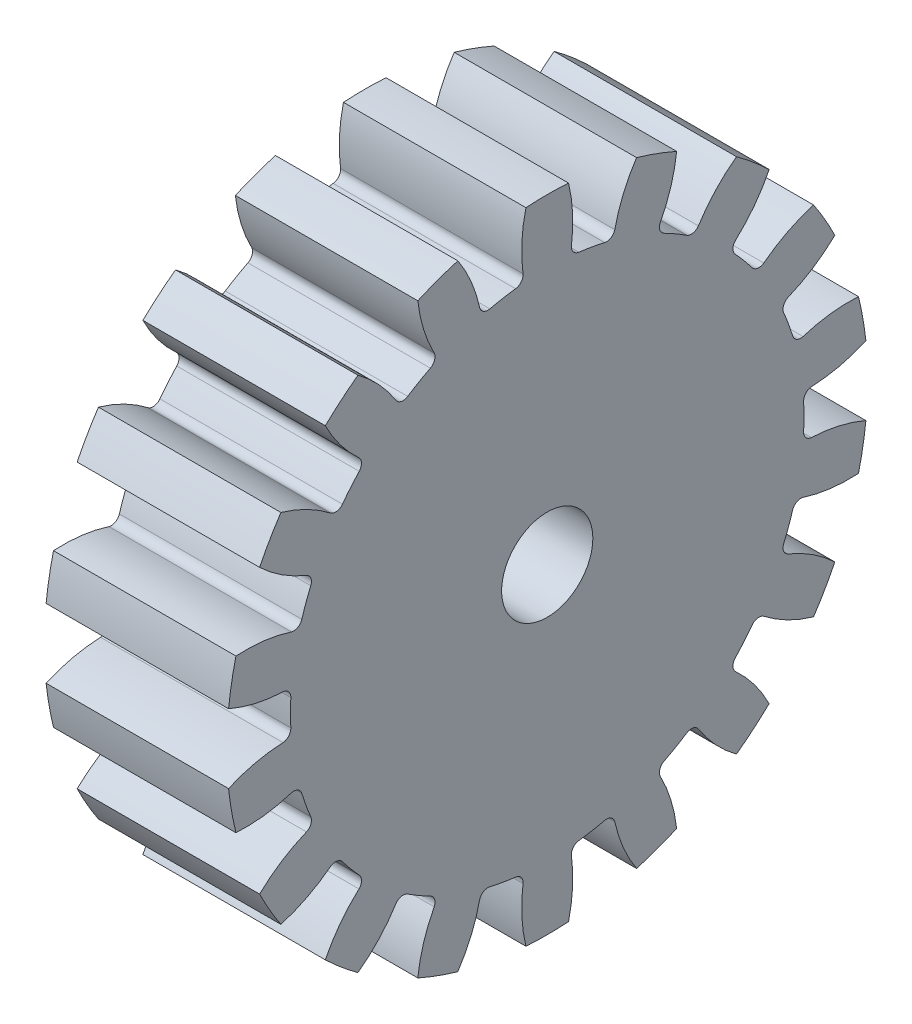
from build123d import *

# Parameters (mm, degrees)
SKETCH1_R           = 1.5
BOSS_EXTRUDE1_DEPTH = 6


with BuildPart() as part:
    # Sketch1 → Boss-Extrude1 (new body)
    with BuildSketch(Plane(origin=(-5.0626, 0, 0), x_dir=(0, -1, 0), z_dir=(-1, 0, 0))):
        with BuildLine():
            ThreePointArc((-5.090436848, -6.736072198), (-4.982381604, -6.916745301), (-5.030440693, -7.121706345))
            ThreePointArc((-5.030440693, -7.121706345), (-5.524579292, -7.900906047), (-5.865718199, -8.758197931))
            ThreePointArc((-5.865718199, -8.758197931), (-5.2705, -9.128773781), (-4.6519628, -9.458959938))
            ThreePointArc((-4.6519628, -9.458959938), (-4.079758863, -8.735097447), (-3.652358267, -7.917342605))
            ThreePointArc((-3.652358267, -7.917342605), (-3.49888634, -7.773241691), (-3.288391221, -7.776483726))
            ThreePointArc((-3.288391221, -7.776483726), (-2.887736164, -7.933989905), (-2.479573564, -8.070869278))
            ThreePointArc((-2.479573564, -8.070869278), (-2.316241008, -8.203689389), (-2.291300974, -8.412726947))
            ThreePointArc((-2.291300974, -8.412726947), (-2.489137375, -9.313940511), (-2.516491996, -10.236207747))
            ThreePointArc((-2.516491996, -10.236207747), (-1.830425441, -10.380858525), (-1.136260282, -10.479579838))
            ThreePointArc((-1.136260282, -10.479579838), (-0.846140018, -9.603666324), (-0.724203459, -8.68904852))
            ThreePointArc((-0.724203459, -8.68904852), (-0.629272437, -8.501147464), (-0.430362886, -8.43220041))
            ThreePointArc((-0.430362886, -8.43220041), (0, -8.443175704), (0.430362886, -8.43220041))
            ThreePointArc((0.430362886, -8.43220041), (0.629272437, -8.501147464), (0.724203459, -8.68904852))
            ThreePointArc((0.724203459, -8.68904852), (0.846531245, -9.60357629), (1.136260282, -10.479579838))
            ThreePointArc((1.136260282, -10.479579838), (1.830425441, -10.380858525), (2.516491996, -10.236207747))
            ThreePointArc((2.516491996, -10.236207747), (2.489535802, -9.313891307), (2.291300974, -8.412726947))
            ThreePointArc((2.291300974, -8.412726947), (2.316241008, -8.203689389), (2.479573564, -8.070869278))
            ThreePointArc((2.479573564, -8.070869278), (2.887736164, -7.933989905), (3.288391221, -7.776483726))
            ThreePointArc((3.288391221, -7.776483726), (3.49888634, -7.773241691), (3.652358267, -7.917342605))
            ThreePointArc((3.652358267, -7.917342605), (4.080095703, -8.734879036), (4.6519628, -9.458959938))
            ThreePointArc((4.6519628, -9.458959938), (5.2705, -9.128773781), (5.865718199, -8.758197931))
            ThreePointArc((5.865718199, -8.758197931), (5.524936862, -7.90072354), (5.030440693, -7.121706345))
            ThreePointArc((5.030440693, -7.121706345), (4.982381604, -6.916745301), (5.090436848, -6.736072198))
            ThreePointArc((5.090436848, -6.736072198), (5.427168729, -6.46784783), (5.749791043, -6.182808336))
            ThreePointArc((5.749791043, -6.182808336), (5.946482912, -6.107768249), (6.139984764, -6.190688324))
            ThreePointArc((6.139984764, -6.190688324), (6.821540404, -6.812626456), (7.606569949, -7.29744987))
            ThreePointArc((7.606569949, -7.29744987), (8.074874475, -6.775624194), (8.507452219, -6.223820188))
            ThreePointArc((8.507452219, -6.223820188), (7.893948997, -5.534611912), (7.162835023, -4.971702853))
            ThreePointArc((7.162835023, -4.971702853), (7.047573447, -4.795539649), (7.087318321, -4.588805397))
            ThreePointArc((7.087318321, -4.588805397), (7.312004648, -4.221587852), (7.517681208, -3.843395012))
            ThreePointArc((7.517681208, -3.843395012), (7.676845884, -3.705607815), (7.887038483, -3.717345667))
            ThreePointArc((7.887038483, -3.717345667), (8.740206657, -4.068670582), (9.643712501, -4.255759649))
            ThreePointArc((9.643712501, -4.255759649), (9.905299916, -3.605234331), (10.123061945, -2.938757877))
            ThreePointArc((10.123061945, -2.938757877), (9.310834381, -2.500944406), (8.431285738, -2.222038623))
            ThreePointArc((8.431285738, -2.222038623), (8.26272392, -2.09592114), (8.229364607, -1.888060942))
            ThreePointArc((8.229364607, -1.888060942), (8.314904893, -1.466142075), (8.378828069, -1.040411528))
            ThreePointArc((8.378828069, -1.040411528), (8.481267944, -0.85649639), (8.68279896, -0.79563626))
            ThreePointArc((8.68279896, -0.79563626), (9.604674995, -0.833972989), (10.517681, -0.700762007))
            ThreePointArc((10.517681, -0.700762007), (10.541, 0), (10.517681, 0.700762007))
            ThreePointArc((10.517681, 0.700762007), (9.604695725, 0.834373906), (8.68279896, 0.79563626))
            ThreePointArc((8.68279896, 0.79563626), (8.481267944, 0.85649639), (8.378828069, 1.040411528))
            ThreePointArc((8.378828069, 1.040411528), (8.314904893, 1.466142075), (8.229364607, 1.888060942))
            ThreePointArc((8.229364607, 1.888060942), (8.26272392, 2.09592114), (8.431285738, 2.222038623))
            ThreePointArc((8.431285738, 2.222038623), (9.310677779, 2.501314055), (10.123061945, 2.938757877))
            ThreePointArc((10.123061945, 2.938757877), (9.905299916, 3.605234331), (9.643712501, 4.255759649))
            ThreePointArc((9.643712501, 4.255759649), (8.740089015, 4.069054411), (7.887038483, 3.717345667))
            ThreePointArc((7.887038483, 3.717345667), (7.676845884, 3.705607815), (7.517681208, 3.843395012))
            ThreePointArc((7.517681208, 3.843395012), (7.312004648, 4.221587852), (7.087318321, 4.588805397))
            ThreePointArc((7.087318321, 4.588805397), (7.047573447, 4.795539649), (7.162835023, 4.971702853))
            ThreePointArc((7.162835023, 4.971702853), (7.893675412, 5.534905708), (8.507452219, 6.223820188))
            ThreePointArc((8.507452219, 6.223820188), (8.074874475, 6.775624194), (7.606569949, 7.29744987))
            ThreePointArc((7.606569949, 7.29744987), (6.821298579, 6.812946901), (6.139984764, 6.190688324))
            ThreePointArc((6.139984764, 6.190688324), (5.946482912, 6.107768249), (5.749791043, 6.182808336))
            ThreePointArc((5.749791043, 6.182808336), (5.427168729, 6.46784783), (5.090436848, 6.736072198))
            ThreePointArc((5.090436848, 6.736072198), (4.982381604, 6.916745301), (5.030440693, 7.121706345))
            ThreePointArc((5.030440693, 7.121706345), (5.524579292, 7.900906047), (5.865718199, 8.758197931))
            ThreePointArc((5.865718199, 8.758197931), (5.2705, 9.128773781), (4.6519628, 9.458959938))
            ThreePointArc((4.6519628, 9.458959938), (4.079758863, 8.735097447), (3.652358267, 7.917342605))
            ThreePointArc((3.652358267, 7.917342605), (3.49888634, 7.773241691), (3.288391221, 7.776483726))
            ThreePointArc((3.288391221, 7.776483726), (2.887736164, 7.933989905), (2.479573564, 8.070869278))
            ThreePointArc((2.479573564, 8.070869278), (2.316241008, 8.203689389), (2.291300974, 8.412726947))
            ThreePointArc((2.291300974, 8.412726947), (2.489137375, 9.313940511), (2.516491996, 10.236207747))
            ThreePointArc((2.516491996, 10.236207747), (1.830425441, 10.380858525), (1.136260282, 10.479579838))
            ThreePointArc((1.136260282, 10.479579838), (0.846140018, 9.603666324), (0.724203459, 8.68904852))
            ThreePointArc((0.724203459, 8.68904852), (0.629272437, 8.501147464), (0.430362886, 8.43220041))
            ThreePointArc((0.430362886, 8.43220041), (0, 8.443175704), (-0.430362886, 8.43220041))
            ThreePointArc((-0.430362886, 8.43220041), (-0.629272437, 8.501147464), (-0.724203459, 8.68904852))
            ThreePointArc((-0.724203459, 8.68904852), (-0.846531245, 9.60357629), (-1.136260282, 10.479579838))
            ThreePointArc((-1.136260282, 10.479579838), (-1.830425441, 10.380858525), (-2.516491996, 10.236207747))
            ThreePointArc((-2.516491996, 10.236207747), (-2.489535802, 9.313891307), (-2.291300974, 8.412726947))
            ThreePointArc((-2.291300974, 8.412726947), (-2.316241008, 8.203689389), (-2.479573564, 8.070869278))
            ThreePointArc((-2.479573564, 8.070869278), (-2.887736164, 7.933989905), (-3.288391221, 7.776483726))
            ThreePointArc((-3.288391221, 7.776483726), (-3.49888634, 7.773241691), (-3.652358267, 7.917342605))
            ThreePointArc((-3.652358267, 7.917342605), (-4.080095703, 8.734879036), (-4.6519628, 9.458959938))
            ThreePointArc((-4.6519628, 9.458959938), (-5.2705, 9.128773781), (-5.865718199, 8.758197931))
            ThreePointArc((-5.865718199, 8.758197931), (-5.524936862, 7.90072354), (-5.030440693, 7.121706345))
            ThreePointArc((-5.030440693, 7.121706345), (-4.982381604, 6.916745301), (-5.090436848, 6.736072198))
            ThreePointArc((-5.090436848, 6.736072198), (-5.427168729, 6.46784783), (-5.749791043, 6.182808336))
            ThreePointArc((-5.749791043, 6.182808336), (-5.946482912, 6.107768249), (-6.139984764, 6.190688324))
            ThreePointArc((-6.139984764, 6.190688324), (-6.821540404, 6.812626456), (-7.606569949, 7.29744987))
            ThreePointArc((-7.606569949, 7.29744987), (-8.074874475, 6.775624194), (-8.507452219, 6.223820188))
            ThreePointArc((-8.507452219, 6.223820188), (-7.893948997, 5.534611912), (-7.162835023, 4.971702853))
            ThreePointArc((-7.162835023, 4.971702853), (-7.047573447, 4.795539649), (-7.087318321, 4.588805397))
            ThreePointArc((-7.087318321, 4.588805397), (-7.312004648, 4.221587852), (-7.517681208, 3.843395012))
            ThreePointArc((-7.517681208, 3.843395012), (-7.676845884, 3.705607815), (-7.887038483, 3.717345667))
            ThreePointArc((-7.887038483, 3.717345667), (-8.740206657, 4.068670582), (-9.643712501, 4.255759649))
            ThreePointArc((-9.643712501, 4.255759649), (-9.905299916, 3.605234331), (-10.123061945, 2.938757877))
            ThreePointArc((-10.123061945, 2.938757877), (-9.310834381, 2.500944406), (-8.431285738, 2.222038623))
            ThreePointArc((-8.431285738, 2.222038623), (-8.26272392, 2.09592114), (-8.229364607, 1.888060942))
            ThreePointArc((-8.229364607, 1.888060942), (-8.314904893, 1.466142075), (-8.378828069, 1.040411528))
            ThreePointArc((-8.378828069, 1.040411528), (-8.481267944, 0.85649639), (-8.68279896, 0.79563626))
            ThreePointArc((-8.68279896, 0.79563626), (-9.604674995, 0.833972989), (-10.517681, 0.700762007))
            ThreePointArc((-10.517681, 0.700762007), (-10.541, 0), (-10.517681, -0.700762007))
            ThreePointArc((-10.517681, -0.700762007), (-9.604695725, -0.834373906), (-8.68279896, -0.79563626))
            ThreePointArc((-8.68279896, -0.79563626), (-8.481267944, -0.85649639), (-8.378828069, -1.040411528))
            ThreePointArc((-8.378828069, -1.040411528), (-8.314904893, -1.466142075), (-8.229364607, -1.888060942))
            ThreePointArc((-8.229364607, -1.888060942), (-8.26272392, -2.09592114), (-8.431285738, -2.222038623))
            ThreePointArc((-8.431285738, -2.222038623), (-9.310677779, -2.501314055), (-10.123061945, -2.938757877))
            ThreePointArc((-10.123061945, -2.938757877), (-9.905299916, -3.605234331), (-9.643712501, -4.255759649))
            ThreePointArc((-9.643712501, -4.255759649), (-8.740089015, -4.069054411), (-7.887038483, -3.717345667))
            ThreePointArc((-7.887038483, -3.717345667), (-7.676845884, -3.705607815), (-7.517681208, -3.843395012))
            ThreePointArc((-7.517681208, -3.843395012), (-7.312004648, -4.221587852), (-7.087318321, -4.588805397))
            ThreePointArc((-7.087318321, -4.588805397), (-7.047573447, -4.795539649), (-7.162835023, -4.971702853))
            ThreePointArc((-7.162835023, -4.971702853), (-7.893675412, -5.534905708), (-8.507452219, -6.223820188))
            ThreePointArc((-8.507452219, -6.223820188), (-8.074874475, -6.775624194), (-7.606569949, -7.29744987))
            ThreePointArc((-7.606569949, -7.29744987), (-6.821298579, -6.812946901), (-6.139984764, -6.190688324))
            ThreePointArc((-6.139984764, -6.190688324), (-5.946482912, -6.107768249), (-5.749791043, -6.182808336))
            ThreePointArc((-5.749791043, -6.182808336), (-5.427168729, -6.46784783), (-5.090436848, -6.736072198))
        make_face()
        with Locations(Location((0, 0, 0), (0, 0, 270))):
            Circle(SKETCH1_R, mode=Mode.SUBTRACT)
    extrude(amount=-BOSS_EXTRUDE1_DEPTH)


solid = part.part
